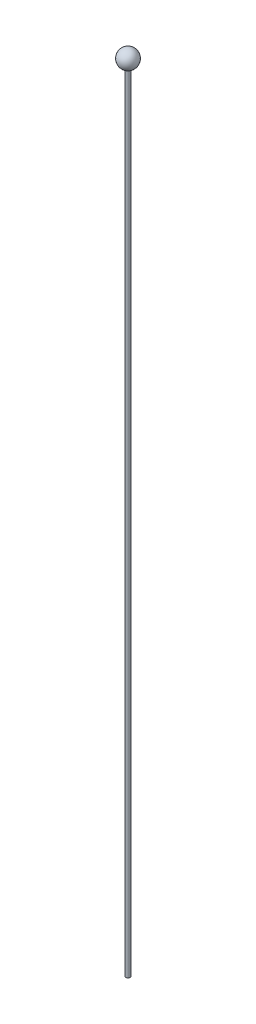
ISO-10303-21;
HEADER;
FILE_DESCRIPTION(('STEP AP214'),'2;1');
FILE_NAME('part.step','',(''),(''),'','','');
FILE_SCHEMA(('AUTOMOTIVE_DESIGN { 1 0 10303 214 1 1 1 1 }'));
ENDSEC;
DATA;
#1=APPLICATION_CONTEXT('core data for automotive mechanical design processes');
#2=APPLICATION_PROTOCOL_DEFINITION('international standard','automotive_design',2000,#1);
#3=PRODUCT_CONTEXT('',#1,'mechanical');
#4=PRODUCT('Part','Part','',(#3));
#5=PRODUCT_RELATED_PRODUCT_CATEGORY('part','',(#4));
#6=PRODUCT_DEFINITION_FORMATION('','',#4);
#7=PRODUCT_DEFINITION_CONTEXT('part definition',#1,'design');
#8=PRODUCT_DEFINITION('design','',#6,#7);
#9=PRODUCT_DEFINITION_SHAPE('','',#8);
#10=(LENGTH_UNIT() NAMED_UNIT(*) SI_UNIT(.MILLI.,.METRE.));
#11=(NAMED_UNIT(*) PLANE_ANGLE_UNIT() SI_UNIT($,.RADIAN.));
#12=(NAMED_UNIT(*) SI_UNIT($,.STERADIAN.) SOLID_ANGLE_UNIT());
#13=UNCERTAINTY_MEASURE_WITH_UNIT(LENGTH_MEASURE(1.E-05),#10,'distance_accuracy_value','');
#14=(GEOMETRIC_REPRESENTATION_CONTEXT(3) GLOBAL_UNCERTAINTY_ASSIGNED_CONTEXT((#13)) GLOBAL_UNIT_ASSIGNED_CONTEXT((#10,
#11,#12)) REPRESENTATION_CONTEXT('',''));
#15=CARTESIAN_POINT('',(0.,0.,0.));
#16=DIRECTION('',(0.,0.,1.));
#17=DIRECTION('',(1.,0.,0.));
#18=AXIS2_PLACEMENT_3D('',#15,#16,#17);
#19=CARTESIAN_POINT('',(0.250000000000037,0.,0.));
#20=DIRECTION('',(0.,-1.,0.));
#21=DIRECTION('',(0.,0.,-1.));
#22=AXIS2_PLACEMENT_3D('',#19,#20,#21);
#23=PLANE('',#22);
#24=CARTESIAN_POINT('',(0.,0.,0.));
#25=DIRECTION('',(0.,-1.,0.));
#26=DIRECTION('',(0.,0.,-1.));
#27=AXIS2_PLACEMENT_3D('',#24,#25,#26);
#28=CIRCLE('',#27,0.250000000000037);
#29=CARTESIAN_POINT('',(0.,0.,-0.250000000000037));
#30=VERTEX_POINT('',#29);
#31=EDGE_CURVE('E10',#30,#30,#28,.T.);
#32=ORIENTED_EDGE('',*,*,#31,.T.);
#33=EDGE_LOOP('',(#32));
#34=FACE_BOUND('',#33,.T.);
#35=ADVANCED_FACE('F34',(#34),#23,.T.);
#36=CARTESIAN_POINT('',(0.,0.,0.));
#37=DIRECTION('',(0.,-1.,0.));
#38=DIRECTION('',(0.,0.,-1.));
#39=AXIS2_PLACEMENT_3D('',#36,#37,#38);
#40=CYLINDRICAL_SURFACE('',#39,0.25000000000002);
#41=CARTESIAN_POINT('',(0.,89.0317541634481,0.));
#42=DIRECTION('',(0.,-1.,0.));
#43=DIRECTION('',(0.,0.,-1.));
#44=AXIS2_PLACEMENT_3D('',#41,#42,#43);
#45=CIRCLE('',#44,0.250000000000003);
#46=CARTESIAN_POINT('',(0.,89.0317541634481,-0.250000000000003));
#47=VERTEX_POINT('',#46);
#48=EDGE_CURVE('E40',#47,#47,#45,.T.);
#49=ORIENTED_EDGE('',*,*,#48,.T.);
#50=EDGE_LOOP('',(#49));
#51=FACE_BOUND('',#50,.T.);
#52=ORIENTED_EDGE('',*,*,#31,.F.);
#53=EDGE_LOOP('',(#52));
#54=FACE_BOUND('',#53,.T.);
#55=ADVANCED_FACE('F46',(#51,#54),#40,.T.);
#56=CARTESIAN_POINT('',(0.,90.,0.));
#57=DIRECTION('',(0.,-1.,0.));
#58=DIRECTION('',(1.,0.,0.));
#59=AXIS2_PLACEMENT_3D('',#56,#57,#58);
#60=SPHERICAL_SURFACE('',#59,0.999999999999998);
#61=ORIENTED_EDGE('',*,*,#48,.F.);
#62=EDGE_LOOP('',(#61));
#63=FACE_BOUND('',#62,.T.);
#64=ADVANCED_FACE('F49',(#63),#60,.T.);
#65=CLOSED_SHELL('',(#35,#55,#64));
#66=MANIFOLD_SOLID_BREP('B2',#65);
#67=ADVANCED_BREP_SHAPE_REPRESENTATION('',(#18,#66),#14);
#68=SHAPE_DEFINITION_REPRESENTATION(#9,#67);
ENDSEC;
END-ISO-10303-21;
